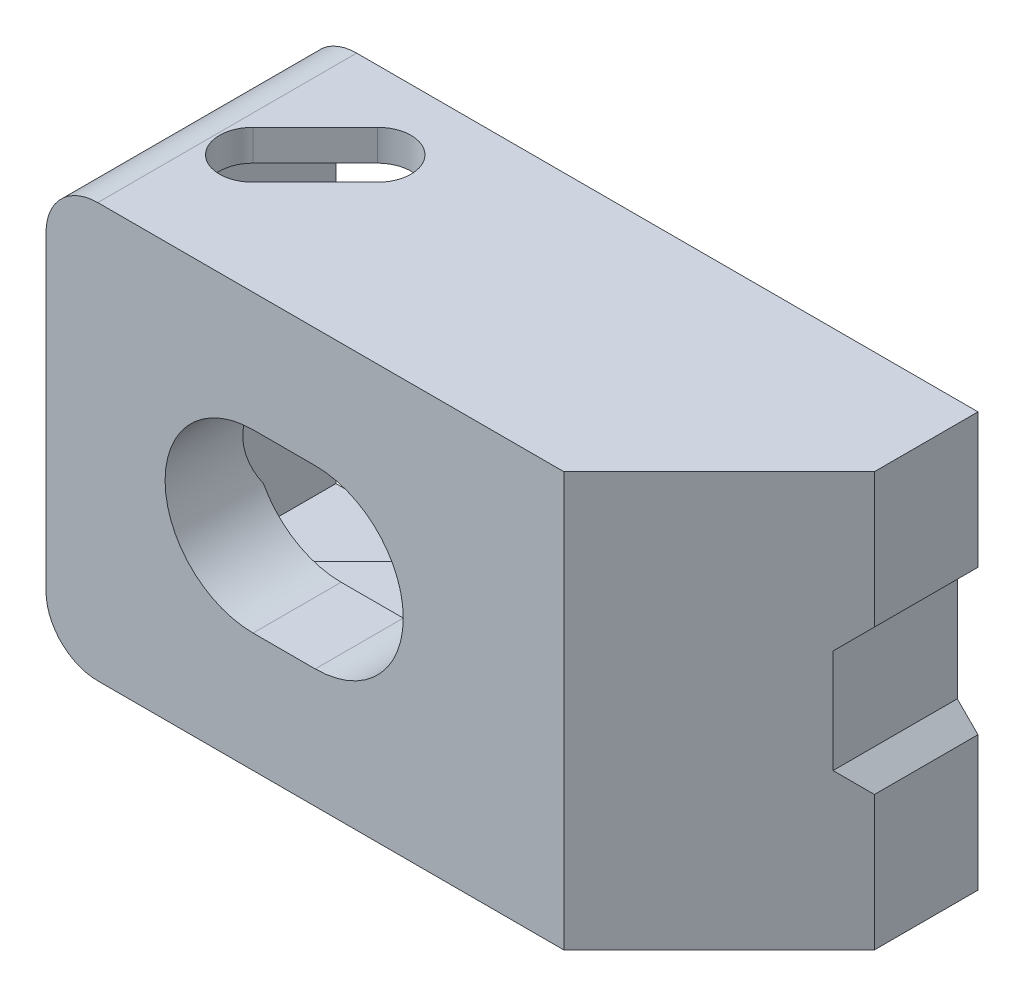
ISO-10303-21;
HEADER;
FILE_DESCRIPTION(('STEP AP214'),'2;1');
FILE_NAME('part.step','',(''),(''),'','','');
FILE_SCHEMA(('AUTOMOTIVE_DESIGN { 1 0 10303 214 1 1 1 1 }'));
ENDSEC;
DATA;
#1=APPLICATION_CONTEXT('core data for automotive mechanical design processes');
#2=APPLICATION_PROTOCOL_DEFINITION('international standard','automotive_design',2000,#1);
#3=PRODUCT_CONTEXT('',#1,'mechanical');
#4=PRODUCT('Part','Part','',(#3));
#5=PRODUCT_RELATED_PRODUCT_CATEGORY('part','',(#4));
#6=PRODUCT_DEFINITION_FORMATION('','',#4);
#7=PRODUCT_DEFINITION_CONTEXT('part definition',#1,'design');
#8=PRODUCT_DEFINITION('design','',#6,#7);
#9=PRODUCT_DEFINITION_SHAPE('','',#8);
#10=(LENGTH_UNIT() NAMED_UNIT(*) SI_UNIT(.MILLI.,.METRE.));
#11=(NAMED_UNIT(*) PLANE_ANGLE_UNIT() SI_UNIT($,.RADIAN.));
#12=(NAMED_UNIT(*) SI_UNIT($,.STERADIAN.) SOLID_ANGLE_UNIT());
#13=UNCERTAINTY_MEASURE_WITH_UNIT(LENGTH_MEASURE(1.E-05),#10,'distance_accuracy_value','');
#14=(GEOMETRIC_REPRESENTATION_CONTEXT(3) GLOBAL_UNCERTAINTY_ASSIGNED_CONTEXT((#13)) GLOBAL_UNIT_ASSIGNED_CONTEXT((#10,
#11,#12)) REPRESENTATION_CONTEXT('',''));
#15=CARTESIAN_POINT('',(0.,0.,0.));
#16=DIRECTION('',(0.,0.,1.));
#17=DIRECTION('',(1.,0.,0.));
#18=AXIS2_PLACEMENT_3D('',#15,#16,#17);
#19=CARTESIAN_POINT('',(39.,-20.,-40.3112887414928));
#20=DIRECTION('',(1.,0.,0.));
#21=DIRECTION('',(0.,0.,1.));
#22=AXIS2_PLACEMENT_3D('',#19,#20,#21);
#23=PLANE('',#22);
#24=DIRECTION('',(0.,1.,0.));
#25=VECTOR('',#24,1.);
#26=CARTESIAN_POINT('',(39.,-20.,10.));
#27=LINE('',#26,#25);
#28=CARTESIAN_POINT('',(39.,-20.,10.));
#29=VERTEX_POINT('',#28);
#30=CARTESIAN_POINT('',(39.,-7.,10.));
#31=VERTEX_POINT('',#30);
#32=EDGE_CURVE('E276',#29,#31,#27,.T.);
#33=ORIENTED_EDGE('',*,*,#32,.F.);
#34=DIRECTION('',(0.,0.,1.));
#35=VECTOR('',#34,1.);
#36=CARTESIAN_POINT('',(39.,-20.,-40.3112887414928));
#37=LINE('',#36,#35);
#38=CARTESIAN_POINT('',(39.,-20.,0.));
#39=VERTEX_POINT('',#38);
#40=EDGE_CURVE('E293',#39,#29,#37,.T.);
#41=ORIENTED_EDGE('',*,*,#40,.F.);
#42=DIRECTION('',(0.,-1.,0.));
#43=VECTOR('',#42,1.);
#44=CARTESIAN_POINT('',(39.,-20.,0.));
#45=LINE('',#44,#43);
#46=CARTESIAN_POINT('',(39.,-7.,0.));
#47=VERTEX_POINT('',#46);
#48=EDGE_CURVE('E292',#47,#39,#45,.T.);
#49=ORIENTED_EDGE('',*,*,#48,.F.);
#50=DIRECTION('',(0.,0.,-1.));
#51=VECTOR('',#50,1.);
#52=CARTESIAN_POINT('',(39.,-7.,-40.3112887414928));
#53=LINE('',#52,#51);
#54=EDGE_CURVE('E589',#31,#47,#53,.T.);
#55=ORIENTED_EDGE('',*,*,#54,.F.);
#56=EDGE_LOOP('',(#33,#41,#49,#55));
#57=FACE_BOUND('',#56,.T.);
#58=ADVANCED_FACE('F14',(#57),#23,.T.);
#59=CARTESIAN_POINT('',(0.,0.,16.5));
#60=DIRECTION('',(0.,0.,-1.));
#61=DIRECTION('',(1.,0.,0.));
#62=AXIS2_PLACEMENT_3D('',#59,#60,#61);
#63=CYLINDRICAL_SURFACE('',#62,10.5);
#64=CARTESIAN_POINT('',(0.,0.,9.));
#65=DIRECTION('',(0.,0.,1.));
#66=DIRECTION('',(-1.,0.,0.));
#67=AXIS2_PLACEMENT_3D('',#64,#65,#66);
#68=CIRCLE('',#67,10.5);
#69=CARTESIAN_POINT('',(0.,10.5,9.));
#70=VERTEX_POINT('',#69);
#71=CARTESIAN_POINT('',(8.94427190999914,5.5,9.));
#72=VERTEX_POINT('',#71);
#73=EDGE_CURVE('E532',#70,#72,#68,.F.);
#74=ORIENTED_EDGE('',*,*,#73,.T.);
#75=DIRECTION('',(0.,0.,-1.));
#76=VECTOR('',#75,1.);
#77=CARTESIAN_POINT('',(8.94427190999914,5.5,16.5));
#78=LINE('',#77,#76);
#79=CARTESIAN_POINT('',(8.94427190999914,5.5,16.5));
#80=VERTEX_POINT('',#79);
#81=EDGE_CURVE('E377',#80,#72,#78,.T.);
#82=ORIENTED_EDGE('',*,*,#81,.F.);
#83=CARTESIAN_POINT('',(0.,0.,16.5));
#84=DIRECTION('',(0.,0.,-1.));
#85=DIRECTION('',(1.,0.,0.));
#86=AXIS2_PLACEMENT_3D('',#83,#84,#85);
#87=CIRCLE('',#86,10.5);
#88=CARTESIAN_POINT('',(0.,10.5,16.5));
#89=VERTEX_POINT('',#88);
#90=EDGE_CURVE('E489',#89,#80,#87,.T.);
#91=ORIENTED_EDGE('',*,*,#90,.F.);
#92=DIRECTION('',(0.,0.,-1.));
#93=VECTOR('',#92,1.);
#94=CARTESIAN_POINT('',(0.,10.5,16.5));
#95=LINE('',#94,#93);
#96=EDGE_CURVE('E495',#89,#70,#95,.T.);
#97=ORIENTED_EDGE('',*,*,#96,.T.);
#98=EDGE_LOOP('',(#74,#82,#91,#97));
#99=FACE_BOUND('',#98,.T.);
#100=ADVANCED_FACE('F666',(#99),#63,.F.);
#101=CARTESIAN_POINT('',(19.4558441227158,-17.,9.));
#102=DIRECTION('',(0.,0.,1.));
#103=DIRECTION('',(-1.,0.,0.));
#104=AXIS2_PLACEMENT_3D('',#101,#102,#103);
#105=PLANE('',#104);
#106=DIRECTION('',(0.,1.,0.));
#107=VECTOR('',#106,1.);
#108=CARTESIAN_POINT('',(19.4558441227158,-17.,9.));
#109=LINE('',#108,#107);
#110=CARTESIAN_POINT('',(19.4558441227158,5.5,9.));
#111=VERTEX_POINT('',#110);
#112=CARTESIAN_POINT('',(19.4558441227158,17.,9.));
#113=VERTEX_POINT('',#112);
#114=EDGE_CURVE('E464',#111,#113,#109,.T.);
#115=ORIENTED_EDGE('',*,*,#114,.F.);
#116=DIRECTION('',(-1.,0.,0.));
#117=VECTOR('',#116,1.);
#118=CARTESIAN_POINT('',(19.4558441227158,5.5,9.));
#119=LINE('',#118,#117);
#120=EDGE_CURVE('E385',#111,#72,#119,.T.);
#121=ORIENTED_EDGE('',*,*,#120,.T.);
#122=ORIENTED_EDGE('',*,*,#73,.F.);
#123=DIRECTION('',(1.,0.,0.));
#124=VECTOR('',#123,1.);
#125=CARTESIAN_POINT('',(-23.,10.5,9.));
#126=LINE('',#125,#124);
#127=CARTESIAN_POINT('',(-6.,10.5,9.));
#128=VERTEX_POINT('',#127);
#129=EDGE_CURVE('E474',#128,#70,#126,.T.);
#130=ORIENTED_EDGE('',*,*,#129,.F.);
#131=DIRECTION('',(0.,1.,0.));
#132=VECTOR('',#131,1.);
#133=CARTESIAN_POINT('',(-6.,-17.,9.));
#134=LINE('',#133,#132);
#135=CARTESIAN_POINT('',(-6.,17.,9.));
#136=VERTEX_POINT('',#135);
#137=EDGE_CURVE('E468',#128,#136,#134,.T.);
#138=ORIENTED_EDGE('',*,*,#137,.T.);
#139=DIRECTION('',(1.,0.,0.));
#140=VECTOR('',#139,1.);
#141=CARTESIAN_POINT('',(19.4558441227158,17.,9.));
#142=LINE('',#141,#140);
#143=EDGE_CURVE('E425',#136,#113,#142,.T.);
#144=ORIENTED_EDGE('',*,*,#143,.T.);
#145=EDGE_LOOP('',(#115,#121,#122,#130,#138,#144));
#146=FACE_BOUND('',#145,.T.);
#147=ADVANCED_FACE('F624',(#146),#105,.F.);
#148=CARTESIAN_POINT('',(-6.,0.,0.));
#149=DIRECTION('',(0.,0.,1.));
#150=DIRECTION('',(-1.,0.,0.));
#151=AXIS2_PLACEMENT_3D('',#148,#149,#150);
#152=CYLINDRICAL_SURFACE('',#151,8.5);
#153=CARTESIAN_POINT('',(-6.,0.,16.5));
#154=DIRECTION('',(0.,0.,-1.));
#155=DIRECTION('',(1.,0.,0.));
#156=AXIS2_PLACEMENT_3D('',#153,#154,#155);
#157=CIRCLE('',#156,8.5);
#158=CARTESIAN_POINT('',(-13.5,-3.99999999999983,16.5));
#159=VERTEX_POINT('',#158);
#160=CARTESIAN_POINT('',(-6.,-8.5,16.5));
#161=VERTEX_POINT('',#160);
#162=EDGE_CURVE('E505',#159,#161,#157,.F.);
#163=ORIENTED_EDGE('',*,*,#162,.F.);
#164=CARTESIAN_POINT('',(-6.,0.,9.));
#165=DIRECTION('',(0.707106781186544,0.,0.707106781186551));
#166=DIRECTION('',(-0.707106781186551,0.,0.707106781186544));
#167=AXIS2_PLACEMENT_3D('',#164,#165,#166);
#168=ELLIPSE('',#167,12.0208152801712,8.5);
#169=CARTESIAN_POINT('',(-13.5,3.99999999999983,16.5));
#170=VERTEX_POINT('',#169);
#171=EDGE_CURVE('E479',#159,#170,#168,.F.);
#172=ORIENTED_EDGE('',*,*,#171,.T.);
#173=CARTESIAN_POINT('',(-6.,8.5,16.5));
#174=VERTEX_POINT('',#173);
#175=EDGE_CURVE('E506',#174,#170,#157,.F.);
#176=ORIENTED_EDGE('',*,*,#175,.F.);
#177=DIRECTION('',(0.,0.,1.));
#178=VECTOR('',#177,1.);
#179=CARTESIAN_POINT('',(-6.,8.5,0.));
#180=LINE('',#179,#178);
#181=CARTESIAN_POINT('',(-6.,8.5,25.));
#182=VERTEX_POINT('',#181);
#183=EDGE_CURVE('E520',#174,#182,#180,.T.);
#184=ORIENTED_EDGE('',*,*,#183,.T.);
#185=CARTESIAN_POINT('',(-6.,0.,25.));
#186=DIRECTION('',(0.,0.,1.));
#187=DIRECTION('',(1.,0.,0.));
#188=AXIS2_PLACEMENT_3D('',#185,#186,#187);
#189=CIRCLE('',#188,8.5);
#190=CARTESIAN_POINT('',(-6.,-8.5,25.));
#191=VERTEX_POINT('',#190);
#192=EDGE_CURVE('E509',#182,#191,#189,.T.);
#193=ORIENTED_EDGE('',*,*,#192,.T.);
#194=DIRECTION('',(0.,0.,1.));
#195=VECTOR('',#194,1.);
#196=CARTESIAN_POINT('',(-6.,-8.5,0.));
#197=LINE('',#196,#195);
#198=EDGE_CURVE('E519',#161,#191,#197,.T.);
#199=ORIENTED_EDGE('',*,*,#198,.F.);
#200=EDGE_LOOP('',(#163,#172,#176,#184,#193,#199));
#201=FACE_BOUND('',#200,.T.);
#202=ADVANCED_FACE('F634',(#201),#152,.F.);
#203=CARTESIAN_POINT('',(-6.,8.5,0.));
#204=DIRECTION('',(0.,1.,0.));
#205=DIRECTION('',(0.,0.,-1.));
#206=AXIS2_PLACEMENT_3D('',#203,#204,#205);
#207=PLANE('',#206);
#208=DIRECTION('',(-1.,0.,0.));
#209=VECTOR('',#208,1.);
#210=CARTESIAN_POINT('',(-6.,8.5,16.5));
#211=LINE('',#210,#209);
#212=CARTESIAN_POINT('',(0.,8.5,16.5));
#213=VERTEX_POINT('',#212);
#214=EDGE_CURVE('E503',#213,#174,#211,.T.);
#215=ORIENTED_EDGE('',*,*,#214,.F.);
#216=DIRECTION('',(0.,0.,1.));
#217=VECTOR('',#216,1.);
#218=CARTESIAN_POINT('',(0.,8.5,0.));
#219=LINE('',#218,#217);
#220=CARTESIAN_POINT('',(0.,8.5,25.));
#221=VERTEX_POINT('',#220);
#222=EDGE_CURVE('E524',#213,#221,#219,.T.);
#223=ORIENTED_EDGE('',*,*,#222,.T.);
#224=DIRECTION('',(-1.,0.,0.));
#225=VECTOR('',#224,1.);
#226=CARTESIAN_POINT('',(-6.,8.5,25.));
#227=LINE('',#226,#225);
#228=EDGE_CURVE('E517',#221,#182,#227,.T.);
#229=ORIENTED_EDGE('',*,*,#228,.T.);
#230=ORIENTED_EDGE('',*,*,#183,.F.);
#231=EDGE_LOOP('',(#215,#223,#229,#230));
#232=FACE_BOUND('',#231,.T.);
#233=ADVANCED_FACE('F653',(#232),#207,.F.);
#234=CARTESIAN_POINT('',(0.,0.,0.));
#235=DIRECTION('',(0.,0.,1.));
#236=DIRECTION('',(-1.,0.,0.));
#237=AXIS2_PLACEMENT_3D('',#234,#235,#236);
#238=CYLINDRICAL_SURFACE('',#237,8.5);
#239=CARTESIAN_POINT('',(0.,0.,16.5));
#240=DIRECTION('',(0.,0.,-1.));
#241=DIRECTION('',(1.,0.,0.));
#242=AXIS2_PLACEMENT_3D('',#239,#240,#241);
#243=CIRCLE('',#242,8.5);
#244=CARTESIAN_POINT('',(0.,-8.5,16.5));
#245=VERTEX_POINT('',#244);
#246=EDGE_CURVE('E499',#245,#213,#243,.F.);
#247=ORIENTED_EDGE('',*,*,#246,.F.);
#248=DIRECTION('',(0.,0.,1.));
#249=VECTOR('',#248,1.);
#250=CARTESIAN_POINT('',(0.,-8.5,0.));
#251=LINE('',#250,#249);
#252=CARTESIAN_POINT('',(0.,-8.5,25.));
#253=VERTEX_POINT('',#252);
#254=EDGE_CURVE('E526',#245,#253,#251,.T.);
#255=ORIENTED_EDGE('',*,*,#254,.T.);
#256=CARTESIAN_POINT('',(0.,0.,25.));
#257=DIRECTION('',(0.,0.,1.));
#258=DIRECTION('',(-1.,0.,0.));
#259=AXIS2_PLACEMENT_3D('',#256,#257,#258);
#260=CIRCLE('',#259,8.5);
#261=EDGE_CURVE('E514',#253,#221,#260,.T.);
#262=ORIENTED_EDGE('',*,*,#261,.T.);
#263=ORIENTED_EDGE('',*,*,#222,.F.);
#264=EDGE_LOOP('',(#247,#255,#262,#263));
#265=FACE_BOUND('',#264,.T.);
#266=ADVANCED_FACE('F645',(#265),#238,.F.);
#267=CARTESIAN_POINT('',(-6.,-8.5,0.));
#268=DIRECTION('',(0.,-1.,0.));
#269=DIRECTION('',(0.,0.,1.));
#270=AXIS2_PLACEMENT_3D('',#267,#268,#269);
#271=PLANE('',#270);
#272=DIRECTION('',(1.,0.,0.));
#273=VECTOR('',#272,1.);
#274=CARTESIAN_POINT('',(-6.,-8.5,16.5));
#275=LINE('',#274,#273);
#276=EDGE_CURVE('E523',#161,#245,#275,.T.);
#277=ORIENTED_EDGE('',*,*,#276,.F.);
#278=ORIENTED_EDGE('',*,*,#198,.T.);
#279=DIRECTION('',(1.,0.,0.));
#280=VECTOR('',#279,1.);
#281=CARTESIAN_POINT('',(-6.,-8.5,25.));
#282=LINE('',#281,#280);
#283=EDGE_CURVE('E512',#191,#253,#282,.T.);
#284=ORIENTED_EDGE('',*,*,#283,.T.);
#285=ORIENTED_EDGE('',*,*,#254,.F.);
#286=EDGE_LOOP('',(#277,#278,#284,#285));
#287=FACE_BOUND('',#286,.T.);
#288=ADVANCED_FACE('F641',(#287),#271,.F.);
#289=CARTESIAN_POINT('',(37.,17.,0.));
#290=DIRECTION('',(0.,0.,1.));
#291=DIRECTION('',(-1.,0.,0.));
#292=AXIS2_PLACEMENT_3D('',#289,#290,#291);
#293=PLANE('',#292);
#294=DIRECTION('',(-1.,0.,0.));
#295=VECTOR('',#294,1.);
#296=CARTESIAN_POINT('',(37.,17.,0.));
#297=LINE('',#296,#295);
#298=CARTESIAN_POINT('',(28.4558441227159,17.,0.));
#299=VERTEX_POINT('',#298);
#300=CARTESIAN_POINT('',(-23.,17.,0.));
#301=VERTEX_POINT('',#300);
#302=EDGE_CURVE('E416',#299,#301,#297,.T.);
#303=ORIENTED_EDGE('',*,*,#302,.T.);
#304=DIRECTION('',(0.,-1.,0.));
#305=VECTOR('',#304,1.);
#306=CARTESIAN_POINT('',(-23.,-20.,0.));
#307=LINE('',#306,#305);
#308=CARTESIAN_POINT('',(-23.,-17.,0.));
#309=VERTEX_POINT('',#308);
#310=EDGE_CURVE('E394',#301,#309,#307,.T.);
#311=ORIENTED_EDGE('',*,*,#310,.T.);
#312=DIRECTION('',(-1.,0.,0.));
#313=VECTOR('',#312,1.);
#314=CARTESIAN_POINT('',(37.,-17.,0.));
#315=LINE('',#314,#313);
#316=CARTESIAN_POINT('',(28.4558441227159,-17.,0.));
#317=VERTEX_POINT('',#316);
#318=EDGE_CURVE('E410',#317,#309,#315,.T.);
#319=ORIENTED_EDGE('',*,*,#318,.F.);
#320=DIRECTION('',(0.,1.,0.));
#321=VECTOR('',#320,1.);
#322=CARTESIAN_POINT('',(28.4558441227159,-17.,0.));
#323=LINE('',#322,#321);
#324=EDGE_CURVE('E441',#317,#299,#323,.T.);
#325=ORIENTED_EDGE('',*,*,#324,.T.);
#326=EDGE_LOOP('',(#303,#311,#319,#325));
#327=FACE_BOUND('',#326,.T.);
#328=DIRECTION('',(-1.,0.,0.));
#329=VECTOR('',#328,1.);
#330=CARTESIAN_POINT('',(37.,-20.,0.));
#331=LINE('',#330,#329);
#332=CARTESIAN_POINT('',(-21.,-20.,0.));
#333=VERTEX_POINT('',#332);
#334=EDGE_CURVE('E421',#39,#333,#331,.T.);
#335=ORIENTED_EDGE('',*,*,#334,.T.);
#336=CARTESIAN_POINT('',(-21.,-15.,0.));
#337=DIRECTION('',(0.,0.,1.));
#338=DIRECTION('',(-1.,0.,0.));
#339=AXIS2_PLACEMENT_3D('',#336,#337,#338);
#340=CIRCLE('',#339,5.);
#341=CARTESIAN_POINT('',(-26.,-15.,0.));
#342=VERTEX_POINT('',#341);
#343=EDGE_CURVE('E22',#333,#342,#340,.F.);
#344=ORIENTED_EDGE('',*,*,#343,.T.);
#345=DIRECTION('',(0.,-1.,0.));
#346=VECTOR('',#345,1.);
#347=CARTESIAN_POINT('',(-26.,-20.,0.));
#348=LINE('',#347,#346);
#349=CARTESIAN_POINT('',(-26.,15.,0.));
#350=VERTEX_POINT('',#349);
#351=EDGE_CURVE('E397',#350,#342,#348,.T.);
#352=ORIENTED_EDGE('',*,*,#351,.F.);
#353=CARTESIAN_POINT('',(-21.,15.,0.));
#354=DIRECTION('',(0.,0.,1.));
#355=DIRECTION('',(-1.,0.,0.));
#356=AXIS2_PLACEMENT_3D('',#353,#354,#355);
#357=CIRCLE('',#356,5.);
#358=CARTESIAN_POINT('',(-21.,20.,0.));
#359=VERTEX_POINT('',#358);
#360=EDGE_CURVE('E29',#350,#359,#357,.F.);
#361=ORIENTED_EDGE('',*,*,#360,.T.);
#362=DIRECTION('',(-1.,0.,0.));
#363=VECTOR('',#362,1.);
#364=CARTESIAN_POINT('',(37.,20.,0.));
#365=LINE('',#364,#363);
#366=CARTESIAN_POINT('',(39.,20.,0.));
#367=VERTEX_POINT('',#366);
#368=EDGE_CURVE('E540',#367,#359,#365,.T.);
#369=ORIENTED_EDGE('',*,*,#368,.F.);
#370=CARTESIAN_POINT('',(39.,7.,0.));
#371=VERTEX_POINT('',#370);
#372=EDGE_CURVE('E291',#367,#371,#45,.T.);
#373=ORIENTED_EDGE('',*,*,#372,.T.);
#374=DIRECTION('',(-0.707106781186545,-0.707106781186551,0.));
#375=VECTOR('',#374,1.);
#376=CARTESIAN_POINT('',(43.,11.,0.));
#377=LINE('',#376,#375);
#378=CARTESIAN_POINT('',(37.,5.,0.));
#379=VERTEX_POINT('',#378);
#380=EDGE_CURVE('E1026',#371,#379,#377,.T.);
#381=ORIENTED_EDGE('',*,*,#380,.T.);
#382=DIRECTION('',(0.,-1.,0.));
#383=VECTOR('',#382,1.);
#384=CARTESIAN_POINT('',(37.,17.,0.));
#385=LINE('',#384,#383);
#386=CARTESIAN_POINT('',(37.,-5.,0.));
#387=VERTEX_POINT('',#386);
#388=EDGE_CURVE('E297',#379,#387,#385,.T.);
#389=ORIENTED_EDGE('',*,*,#388,.T.);
#390=DIRECTION('',(0.707106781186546,-0.707106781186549,0.));
#391=VECTOR('',#390,1.);
#392=CARTESIAN_POINT('',(26.,6.,0.));
#393=LINE('',#392,#391);
#394=EDGE_CURVE('E1028',#387,#47,#393,.T.);
#395=ORIENTED_EDGE('',*,*,#394,.T.);
#396=ORIENTED_EDGE('',*,*,#48,.T.);
#397=EDGE_LOOP('',(#335,#344,#352,#361,#369,#373,#381,#389,#395,#396));
#398=FACE_BOUND('',#397,.T.);
#399=ADVANCED_FACE('F16',(#327,#398),#293,.F.);
#400=CARTESIAN_POINT('',(0.,0.,25.));
#401=DIRECTION('',(0.,0.,1.));
#402=DIRECTION('',(-1.,0.,0.));
#403=AXIS2_PLACEMENT_3D('',#400,#401,#402);
#404=PLANE('',#403);
#405=DIRECTION('',(0.,1.,0.));
#406=VECTOR('',#405,1.);
#407=CARTESIAN_POINT('',(-26.,-20.,25.));
#408=LINE('',#407,#406);
#409=CARTESIAN_POINT('',(-26.,-15.,25.));
#410=VERTEX_POINT('',#409);
#411=CARTESIAN_POINT('',(-26.,15.,25.));
#412=VERTEX_POINT('',#411);
#413=EDGE_CURVE('E391',#410,#412,#408,.T.);
#414=ORIENTED_EDGE('',*,*,#413,.F.);
#415=CARTESIAN_POINT('',(-21.,-15.,25.));
#416=DIRECTION('',(0.,0.,1.));
#417=DIRECTION('',(-1.,0.,0.));
#418=AXIS2_PLACEMENT_3D('',#415,#416,#417);
#419=CIRCLE('',#418,5.);
#420=CARTESIAN_POINT('',(-21.,-20.,25.));
#421=VERTEX_POINT('',#420);
#422=EDGE_CURVE('E580',#410,#421,#419,.T.);
#423=ORIENTED_EDGE('',*,*,#422,.T.);
#424=DIRECTION('',(-1.,0.,0.));
#425=VECTOR('',#424,1.);
#426=CARTESIAN_POINT('',(-1.,-20.,25.));
#427=LINE('',#426,#425);
#428=CARTESIAN_POINT('',(24.,-20.,25.));
#429=VERTEX_POINT('',#428);
#430=EDGE_CURVE('E389',#429,#421,#427,.T.);
#431=ORIENTED_EDGE('',*,*,#430,.F.);
#432=DIRECTION('',(0.,1.,0.));
#433=VECTOR('',#432,1.);
#434=CARTESIAN_POINT('',(24.,-20.,25.));
#435=LINE('',#434,#433);
#436=CARTESIAN_POINT('',(24.,20.,25.));
#437=VERTEX_POINT('',#436);
#438=EDGE_CURVE('E1020',#429,#437,#435,.T.);
#439=ORIENTED_EDGE('',*,*,#438,.T.);
#440=DIRECTION('',(-1.,0.,0.));
#441=VECTOR('',#440,1.);
#442=CARTESIAN_POINT('',(-1.,20.,25.));
#443=LINE('',#442,#441);
#444=CARTESIAN_POINT('',(-21.,20.,25.));
#445=VERTEX_POINT('',#444);
#446=EDGE_CURVE('E286',#437,#445,#443,.T.);
#447=ORIENTED_EDGE('',*,*,#446,.T.);
#448=CARTESIAN_POINT('',(-21.,15.,25.));
#449=DIRECTION('',(0.,0.,1.));
#450=DIRECTION('',(-1.,0.,0.));
#451=AXIS2_PLACEMENT_3D('',#448,#449,#450);
#452=CIRCLE('',#451,5.);
#453=EDGE_CURVE('E582',#445,#412,#452,.T.);
#454=ORIENTED_EDGE('',*,*,#453,.T.);
#455=EDGE_LOOP('',(#414,#423,#431,#439,#447,#454));
#456=FACE_BOUND('',#455,.T.);
#457=ORIENTED_EDGE('',*,*,#192,.F.);
#458=ORIENTED_EDGE('',*,*,#228,.F.);
#459=ORIENTED_EDGE('',*,*,#261,.F.);
#460=ORIENTED_EDGE('',*,*,#283,.F.);
#461=EDGE_LOOP('',(#457,#458,#459,#460));
#462=FACE_BOUND('',#461,.T.);
#463=ADVANCED_FACE('F650',(#456,#462),#404,.T.);
#464=CARTESIAN_POINT('',(0.,0.,16.5));
#465=DIRECTION('',(0.,0.,-1.));
#466=DIRECTION('',(1.,0.,0.));
#467=AXIS2_PLACEMENT_3D('',#464,#465,#466);
#468=PLANE('',#467);
#469=DIRECTION('',(0.,-1.,0.));
#470=VECTOR('',#469,1.);
#471=CARTESIAN_POINT('',(-13.5,0.,16.5));
#472=LINE('',#471,#470);
#473=CARTESIAN_POINT('',(-13.5,10.5,16.5));
#474=VERTEX_POINT('',#473);
#475=EDGE_CURVE('E480',#474,#170,#472,.T.);
#476=ORIENTED_EDGE('',*,*,#475,.F.);
#477=DIRECTION('',(1.,0.,0.));
#478=VECTOR('',#477,1.);
#479=CARTESIAN_POINT('',(-23.,10.5,16.5));
#480=LINE('',#479,#478);
#481=EDGE_CURVE('E486',#474,#89,#480,.T.);
#482=ORIENTED_EDGE('',*,*,#481,.T.);
#483=ORIENTED_EDGE('',*,*,#90,.T.);
#484=DIRECTION('',(1.,0.,0.));
#485=VECTOR('',#484,1.);
#486=CARTESIAN_POINT('',(20.,5.5,16.5));
#487=LINE('',#486,#485);
#488=CARTESIAN_POINT('',(20.,5.5,16.5));
#489=VERTEX_POINT('',#488);
#490=EDGE_CURVE('E369',#80,#489,#487,.T.);
#491=ORIENTED_EDGE('',*,*,#490,.T.);
#492=CARTESIAN_POINT('',(20.,0.,16.5));
#493=DIRECTION('',(0.,0.,-1.));
#494=DIRECTION('',(1.,0.,0.));
#495=AXIS2_PLACEMENT_3D('',#492,#493,#494);
#496=CIRCLE('',#495,5.5);
#497=CARTESIAN_POINT('',(20.,-5.5,16.5));
#498=VERTEX_POINT('',#497);
#499=EDGE_CURVE('E363',#489,#498,#496,.T.);
#500=ORIENTED_EDGE('',*,*,#499,.T.);
#501=DIRECTION('',(-1.,0.,0.));
#502=VECTOR('',#501,1.);
#503=CARTESIAN_POINT('',(20.,-5.5,16.5));
#504=LINE('',#503,#502);
#505=CARTESIAN_POINT('',(8.94427190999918,-5.5,16.5));
#506=VERTEX_POINT('',#505);
#507=EDGE_CURVE('E366',#498,#506,#504,.T.);
#508=ORIENTED_EDGE('',*,*,#507,.T.);
#509=CARTESIAN_POINT('',(0.,-10.5,16.5));
#510=VERTEX_POINT('',#509);
#511=EDGE_CURVE('E488',#506,#510,#87,.T.);
#512=ORIENTED_EDGE('',*,*,#511,.T.);
#513=DIRECTION('',(-1.,0.,0.));
#514=VECTOR('',#513,1.);
#515=CARTESIAN_POINT('',(-23.,-10.5,16.5));
#516=LINE('',#515,#514);
#517=CARTESIAN_POINT('',(-13.5,-10.5,16.5));
#518=VERTEX_POINT('',#517);
#519=EDGE_CURVE('E492',#510,#518,#516,.T.);
#520=ORIENTED_EDGE('',*,*,#519,.T.);
#521=EDGE_CURVE('E477',#159,#518,#472,.T.);
#522=ORIENTED_EDGE('',*,*,#521,.F.);
#523=ORIENTED_EDGE('',*,*,#162,.T.);
#524=ORIENTED_EDGE('',*,*,#276,.T.);
#525=ORIENTED_EDGE('',*,*,#246,.T.);
#526=ORIENTED_EDGE('',*,*,#214,.T.);
#527=ORIENTED_EDGE('',*,*,#175,.T.);
#528=EDGE_LOOP('',(#476,#482,#483,#491,#500,#508,#512,#520,#522,#523,#524,#525,#526,#527));
#529=FACE_BOUND('',#528,.T.);
#530=ADVANCED_FACE('F615',(#529),#468,.T.);
#531=CARTESIAN_POINT('',(-23.,10.5,16.5));
#532=DIRECTION('',(0.,1.,0.));
#533=DIRECTION('',(0.,0.,-1.));
#534=AXIS2_PLACEMENT_3D('',#531,#532,#533);
#535=PLANE('',#534);
#536=DIRECTION('',(0.707106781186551,0.,-0.707106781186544));
#537=VECTOR('',#536,1.);
#538=CARTESIAN_POINT('',(-18.25,10.5,21.25));
#539=LINE('',#538,#537);
#540=EDGE_CURVE('E483',#474,#128,#539,.T.);
#541=ORIENTED_EDGE('',*,*,#540,.T.);
#542=ORIENTED_EDGE('',*,*,#129,.T.);
#543=ORIENTED_EDGE('',*,*,#96,.F.);
#544=ORIENTED_EDGE('',*,*,#481,.F.);
#545=EDGE_LOOP('',(#541,#542,#543,#544));
#546=FACE_BOUND('',#545,.T.);
#547=ADVANCED_FACE('F627',(#546),#535,.F.);
#548=CARTESIAN_POINT('',(-23.,-10.5,16.5));
#549=DIRECTION('',(0.,-1.,0.));
#550=DIRECTION('',(1.,0.,0.));
#551=AXIS2_PLACEMENT_3D('',#548,#549,#550);
#552=PLANE('',#551);
#553=DIRECTION('',(0.,0.,-1.));
#554=VECTOR('',#553,1.);
#555=CARTESIAN_POINT('',(0.,-10.5,16.5));
#556=LINE('',#555,#554);
#557=CARTESIAN_POINT('',(0.,-10.5,9.));
#558=VERTEX_POINT('',#557);
#559=EDGE_CURVE('E496',#510,#558,#556,.T.);
#560=ORIENTED_EDGE('',*,*,#559,.T.);
#561=DIRECTION('',(-1.,0.,0.));
#562=VECTOR('',#561,1.);
#563=CARTESIAN_POINT('',(-23.,-10.5,9.));
#564=LINE('',#563,#562);
#565=CARTESIAN_POINT('',(-6.,-10.5,9.));
#566=VERTEX_POINT('',#565);
#567=EDGE_CURVE('E444',#558,#566,#564,.T.);
#568=ORIENTED_EDGE('',*,*,#567,.T.);
#569=DIRECTION('',(-0.707106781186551,0.,0.707106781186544));
#570=VECTOR('',#569,1.);
#571=CARTESIAN_POINT('',(-18.25,-10.5,21.25));
#572=LINE('',#571,#570);
#573=EDGE_CURVE('E535',#566,#518,#572,.T.);
#574=ORIENTED_EDGE('',*,*,#573,.T.);
#575=ORIENTED_EDGE('',*,*,#519,.F.);
#576=EDGE_LOOP('',(#560,#568,#574,#575));
#577=FACE_BOUND('',#576,.T.);
#578=ADVANCED_FACE('F767',(#577),#552,.F.);
#579=ORIENTED_EDGE('',*,*,#511,.F.);
#580=DIRECTION('',(0.,0.,-1.));
#581=VECTOR('',#580,1.);
#582=CARTESIAN_POINT('',(8.94427190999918,-5.5,16.5));
#583=LINE('',#582,#581);
#584=CARTESIAN_POINT('',(8.94427190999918,-5.5,9.));
#585=VERTEX_POINT('',#584);
#586=EDGE_CURVE('E379',#506,#585,#583,.T.);
#587=ORIENTED_EDGE('',*,*,#586,.T.);
#588=EDGE_CURVE('E531',#585,#558,#68,.F.);
#589=ORIENTED_EDGE('',*,*,#588,.T.);
#590=ORIENTED_EDGE('',*,*,#559,.F.);
#591=EDGE_LOOP('',(#579,#587,#589,#590));
#592=FACE_BOUND('',#591,.T.);
#593=ADVANCED_FACE('F611',(#592),#63,.F.);
#594=CARTESIAN_POINT('',(-6.,-17.,9.));
#595=DIRECTION('',(0.707106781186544,0.,0.707106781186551));
#596=DIRECTION('',(-0.707106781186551,0.,0.707106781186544));
#597=AXIS2_PLACEMENT_3D('',#594,#595,#596);
#598=PLANE('',#597);
#599=ORIENTED_EDGE('',*,*,#475,.T.);
#600=ORIENTED_EDGE('',*,*,#171,.F.);
#601=ORIENTED_EDGE('',*,*,#521,.T.);
#602=ORIENTED_EDGE('',*,*,#573,.F.);
#603=CARTESIAN_POINT('',(-6.,-17.,9.));
#604=VERTEX_POINT('',#603);
#605=EDGE_CURVE('E465',#604,#566,#134,.T.);
#606=ORIENTED_EDGE('',*,*,#605,.F.);
#607=DIRECTION('',(0.707106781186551,0.,-0.707106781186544));
#608=VECTOR('',#607,1.);
#609=CARTESIAN_POINT('',(-6.,-17.,9.));
#610=LINE('',#609,#608);
#611=CARTESIAN_POINT('',(-17.,-17.,20.));
#612=VERTEX_POINT('',#611);
#613=EDGE_CURVE('E432',#612,#604,#610,.T.);
#614=ORIENTED_EDGE('',*,*,#613,.F.);
#615=DIRECTION('',(0.,1.,0.));
#616=VECTOR('',#615,1.);
#617=CARTESIAN_POINT('',(-17.,-17.,20.));
#618=LINE('',#617,#616);
#619=CARTESIAN_POINT('',(-17.,17.,20.));
#620=VERTEX_POINT('',#619);
#621=EDGE_CURVE('E469',#612,#620,#618,.T.);
#622=ORIENTED_EDGE('',*,*,#621,.T.);
#623=DIRECTION('',(0.707106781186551,0.,-0.707106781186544));
#624=VECTOR('',#623,1.);
#625=CARTESIAN_POINT('',(-6.,17.,9.));
#626=LINE('',#625,#624);
#627=EDGE_CURVE('E422',#620,#136,#626,.T.);
#628=ORIENTED_EDGE('',*,*,#627,.T.);
#629=ORIENTED_EDGE('',*,*,#137,.F.);
#630=ORIENTED_EDGE('',*,*,#540,.F.);
#631=EDGE_LOOP('',(#599,#600,#601,#602,#606,#614,#622,#628,#629,#630));
#632=FACE_BOUND('',#631,.T.);
#633=ADVANCED_FACE('F557',(#632),#598,.F.);
#634=ORIENTED_EDGE('',*,*,#588,.F.);
#635=DIRECTION('',(1.,0.,0.));
#636=VECTOR('',#635,1.);
#637=CARTESIAN_POINT('',(19.4558441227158,-5.5,9.));
#638=LINE('',#637,#636);
#639=CARTESIAN_POINT('',(19.4558441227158,-5.5,9.));
#640=VERTEX_POINT('',#639);
#641=EDGE_CURVE('E376',#585,#640,#638,.T.);
#642=ORIENTED_EDGE('',*,*,#641,.T.);
#643=CARTESIAN_POINT('',(19.4558441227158,-17.,9.));
#644=VERTEX_POINT('',#643);
#645=EDGE_CURVE('E445',#644,#640,#109,.T.);
#646=ORIENTED_EDGE('',*,*,#645,.F.);
#647=DIRECTION('',(1.,0.,0.));
#648=VECTOR('',#647,1.);
#649=CARTESIAN_POINT('',(19.4558441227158,-17.,9.));
#650=LINE('',#649,#648);
#651=EDGE_CURVE('E457',#604,#644,#650,.T.);
#652=ORIENTED_EDGE('',*,*,#651,.F.);
#653=ORIENTED_EDGE('',*,*,#605,.T.);
#654=ORIENTED_EDGE('',*,*,#567,.F.);
#655=EDGE_LOOP('',(#634,#642,#646,#652,#653,#654));
#656=FACE_BOUND('',#655,.T.);
#657=ADVANCED_FACE('F606',(#656),#105,.F.);
#658=CARTESIAN_POINT('',(28.4558441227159,-17.,0.));
#659=DIRECTION('',(0.707106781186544,0.,0.707106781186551));
#660=DIRECTION('',(-0.707106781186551,0.,0.707106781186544));
#661=AXIS2_PLACEMENT_3D('',#658,#659,#660);
#662=PLANE('',#661);
#663=CARTESIAN_POINT('',(20.,0.,8.45584412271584));
#664=DIRECTION('',(0.707106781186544,0.,0.707106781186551));
#665=DIRECTION('',(0.707106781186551,0.,-0.707106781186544));
#666=AXIS2_PLACEMENT_3D('',#663,#664,#665);
#667=ELLIPSE('',#666,7.77817459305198,5.5);
#668=CARTESIAN_POINT('',(20.,-5.5,8.45584412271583));
#669=VERTEX_POINT('',#668);
#670=CARTESIAN_POINT('',(20.,5.5,8.45584412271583));
#671=VERTEX_POINT('',#670);
#672=EDGE_CURVE('E595',#669,#671,#667,.T.);
#673=ORIENTED_EDGE('',*,*,#672,.T.);
#674=DIRECTION('',(-0.707106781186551,0.,0.707106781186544));
#675=VECTOR('',#674,1.);
#676=CARTESIAN_POINT('',(28.4558441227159,5.5,0.));
#677=LINE('',#676,#675);
#678=EDGE_CURVE('E593',#671,#111,#677,.T.);
#679=ORIENTED_EDGE('',*,*,#678,.T.);
#680=ORIENTED_EDGE('',*,*,#114,.T.);
#681=DIRECTION('',(0.707106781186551,0.,-0.707106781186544));
#682=VECTOR('',#681,1.);
#683=CARTESIAN_POINT('',(28.4558441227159,17.,0.));
#684=LINE('',#683,#682);
#685=EDGE_CURVE('E429',#113,#299,#684,.T.);
#686=ORIENTED_EDGE('',*,*,#685,.T.);
#687=ORIENTED_EDGE('',*,*,#324,.F.);
#688=DIRECTION('',(0.707106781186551,0.,-0.707106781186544));
#689=VECTOR('',#688,1.);
#690=CARTESIAN_POINT('',(28.4558441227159,-17.,0.));
#691=LINE('',#690,#689);
#692=EDGE_CURVE('E452',#644,#317,#691,.T.);
#693=ORIENTED_EDGE('',*,*,#692,.F.);
#694=ORIENTED_EDGE('',*,*,#645,.T.);
#695=DIRECTION('',(0.707106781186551,0.,-0.707106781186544));
#696=VECTOR('',#695,1.);
#697=CARTESIAN_POINT('',(28.4558441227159,-5.5,0.));
#698=LINE('',#697,#696);
#699=EDGE_CURVE('E458',#640,#669,#698,.T.);
#700=ORIENTED_EDGE('',*,*,#699,.T.);
#701=EDGE_LOOP('',(#673,#679,#680,#686,#687,#693,#694,#700));
#702=FACE_BOUND('',#701,.T.);
#703=ADVANCED_FACE('F600',(#702),#662,.F.);
#704=CARTESIAN_POINT('',(-17.,-17.,20.));
#705=DIRECTION('',(0.,0.,1.));
#706=DIRECTION('',(-1.,0.,0.));
#707=AXIS2_PLACEMENT_3D('',#704,#705,#706);
#708=PLANE('',#707);
#709=DIRECTION('',(1.,0.,0.));
#710=VECTOR('',#709,1.);
#711=CARTESIAN_POINT('',(-17.,17.,20.));
#712=LINE('',#711,#710);
#713=CARTESIAN_POINT('',(-23.,17.,20.));
#714=VERTEX_POINT('',#713);
#715=EDGE_CURVE('E426',#714,#620,#712,.T.);
#716=ORIENTED_EDGE('',*,*,#715,.T.);
#717=ORIENTED_EDGE('',*,*,#621,.F.);
#718=DIRECTION('',(1.,0.,0.));
#719=VECTOR('',#718,1.);
#720=CARTESIAN_POINT('',(-17.,-17.,20.));
#721=LINE('',#720,#719);
#722=CARTESIAN_POINT('',(-23.,-17.,20.));
#723=VERTEX_POINT('',#722);
#724=EDGE_CURVE('E438',#723,#612,#721,.T.);
#725=ORIENTED_EDGE('',*,*,#724,.F.);
#726=DIRECTION('',(0.,1.,0.));
#727=VECTOR('',#726,1.);
#728=CARTESIAN_POINT('',(-23.,-17.,20.));
#729=LINE('',#728,#727);
#730=EDGE_CURVE('E456',#723,#714,#729,.T.);
#731=ORIENTED_EDGE('',*,*,#730,.T.);
#732=EDGE_LOOP('',(#716,#717,#725,#731));
#733=FACE_BOUND('',#732,.T.);
#734=ADVANCED_FACE('F545',(#733),#708,.F.);
#735=CARTESIAN_POINT('',(37.,20.,40.));
#736=DIRECTION('',(0.,1.,0.));
#737=DIRECTION('',(-1.,0.,0.));
#738=AXIS2_PLACEMENT_3D('',#735,#736,#737);
#739=PLANE('',#738);
#740=ORIENTED_EDGE('',*,*,#368,.T.);
#741=DIRECTION('',(0.,0.,-1.));
#742=VECTOR('',#741,1.);
#743=CARTESIAN_POINT('',(-21.,20.,40.));
#744=LINE('',#743,#742);
#745=EDGE_CURVE('E9',#359,#445,#744,.F.);
#746=ORIENTED_EDGE('',*,*,#745,.T.);
#747=ORIENTED_EDGE('',*,*,#446,.F.);
#748=DIRECTION('',(-0.707106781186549,0.,0.707106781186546));
#749=VECTOR('',#748,1.);
#750=CARTESIAN_POINT('',(39.,20.,10.));
#751=LINE('',#750,#749);
#752=CARTESIAN_POINT('',(39.,20.,10.));
#753=VERTEX_POINT('',#752);
#754=EDGE_CURVE('E268',#753,#437,#751,.T.);
#755=ORIENTED_EDGE('',*,*,#754,.F.);
#756=DIRECTION('',(0.,0.,1.));
#757=VECTOR('',#756,1.);
#758=CARTESIAN_POINT('',(39.,20.,-40.3112887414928));
#759=LINE('',#758,#757);
#760=EDGE_CURVE('E284',#367,#753,#759,.T.);
#761=ORIENTED_EDGE('',*,*,#760,.F.);
#762=EDGE_LOOP('',(#740,#746,#747,#755,#761));
#763=FACE_BOUND('',#762,.T.);
#764=CARTESIAN_POINT('',(-17.5,20.,13.5));
#765=DIRECTION('',(0.,1.,0.));
#766=DIRECTION('',(-1.,0.,0.));
#767=AXIS2_PLACEMENT_3D('',#764,#765,#766);
#768=CIRCLE('',#767,3.25);
#769=CARTESIAN_POINT('',(-19.7980970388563,20.,11.2019029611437));
#770=VERTEX_POINT('',#769);
#771=CARTESIAN_POINT('',(-15.2019029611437,20.,15.7980970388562));
#772=VERTEX_POINT('',#771);
#773=EDGE_CURVE('E301',#770,#772,#768,.T.);
#774=ORIENTED_EDGE('',*,*,#773,.F.);
#775=DIRECTION('',(-0.707106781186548,0.,0.707106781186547));
#776=VECTOR('',#775,1.);
#777=CARTESIAN_POINT('',(-19.7980970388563,20.,11.2019029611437));
#778=LINE('',#777,#776);
#779=CARTESIAN_POINT('',(-13.7980970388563,20.,5.20190296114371));
#780=VERTEX_POINT('',#779);
#781=EDGE_CURVE('E309',#780,#770,#778,.T.);
#782=ORIENTED_EDGE('',*,*,#781,.F.);
#783=CARTESIAN_POINT('',(-11.5,20.,7.5));
#784=DIRECTION('',(0.,1.,0.));
#785=DIRECTION('',(-1.,0.,0.));
#786=AXIS2_PLACEMENT_3D('',#783,#784,#785);
#787=CIRCLE('',#786,3.25);
#788=CARTESIAN_POINT('',(-9.20190296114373,20.,9.79809703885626));
#789=VERTEX_POINT('',#788);
#790=EDGE_CURVE('E306',#789,#780,#787,.T.);
#791=ORIENTED_EDGE('',*,*,#790,.F.);
#792=DIRECTION('',(0.707106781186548,0.,-0.707106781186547));
#793=VECTOR('',#792,1.);
#794=CARTESIAN_POINT('',(-15.2019029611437,20.,15.7980970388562));
#795=LINE('',#794,#793);
#796=EDGE_CURVE('E303',#772,#789,#795,.T.);
#797=ORIENTED_EDGE('',*,*,#796,.F.);
#798=EDGE_LOOP('',(#774,#782,#791,#797));
#799=FACE_BOUND('',#798,.T.);
#800=ADVANCED_FACE('F282',(#763,#799),#739,.T.);
#801=CARTESIAN_POINT('',(37.,17.,40.));
#802=DIRECTION('',(0.,1.,0.));
#803=DIRECTION('',(-1.,0.,0.));
#804=AXIS2_PLACEMENT_3D('',#801,#802,#803);
#805=PLANE('',#804);
#806=DIRECTION('',(-0.707106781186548,0.,0.707106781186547));
#807=VECTOR('',#806,1.);
#808=CARTESIAN_POINT('',(-5.79809703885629,17.,-2.79809703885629));
#809=LINE('',#808,#807);
#810=CARTESIAN_POINT('',(-13.7980970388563,17.,5.20190296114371));
#811=VERTEX_POINT('',#810);
#812=CARTESIAN_POINT('',(-19.7980970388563,17.,11.2019029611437));
#813=VERTEX_POINT('',#812);
#814=EDGE_CURVE('E354',#811,#813,#809,.T.);
#815=ORIENTED_EDGE('',*,*,#814,.T.);
#816=CARTESIAN_POINT('',(-17.5,17.,13.5));
#817=DIRECTION('',(0.,1.,0.));
#818=DIRECTION('',(-1.,0.,0.));
#819=AXIS2_PLACEMENT_3D('',#816,#817,#818);
#820=CIRCLE('',#819,3.25);
#821=CARTESIAN_POINT('',(-15.2019029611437,17.,15.7980970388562));
#822=VERTEX_POINT('',#821);
#823=EDGE_CURVE('E360',#813,#822,#820,.T.);
#824=ORIENTED_EDGE('',*,*,#823,.T.);
#825=DIRECTION('',(0.707106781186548,0.,-0.707106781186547));
#826=VECTOR('',#825,1.);
#827=CARTESIAN_POINT('',(-1.20190296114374,17.,1.79809703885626));
#828=LINE('',#827,#826);
#829=CARTESIAN_POINT('',(-9.20190296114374,17.,9.79809703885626));
#830=VERTEX_POINT('',#829);
#831=EDGE_CURVE('E342',#822,#830,#828,.T.);
#832=ORIENTED_EDGE('',*,*,#831,.T.);
#833=CARTESIAN_POINT('',(-11.5,17.,7.5));
#834=DIRECTION('',(0.,1.,0.));
#835=DIRECTION('',(-1.,0.,0.));
#836=AXIS2_PLACEMENT_3D('',#833,#834,#835);
#837=CIRCLE('',#836,3.25);
#838=EDGE_CURVE('E348',#830,#811,#837,.T.);
#839=ORIENTED_EDGE('',*,*,#838,.T.);
#840=EDGE_LOOP('',(#815,#824,#832,#839));
#841=FACE_BOUND('',#840,.T.);
#842=ORIENTED_EDGE('',*,*,#685,.F.);
#843=ORIENTED_EDGE('',*,*,#143,.F.);
#844=ORIENTED_EDGE('',*,*,#627,.F.);
#845=ORIENTED_EDGE('',*,*,#715,.F.);
#846=DIRECTION('',(0.,0.,1.));
#847=VECTOR('',#846,1.);
#848=CARTESIAN_POINT('',(-23.,17.,0.));
#849=LINE('',#848,#847);
#850=EDGE_CURVE('E420',#301,#714,#849,.T.);
#851=ORIENTED_EDGE('',*,*,#850,.F.);
#852=ORIENTED_EDGE('',*,*,#302,.F.);
#853=EDGE_LOOP('',(#842,#843,#844,#845,#851,#852));
#854=FACE_BOUND('',#853,.T.);
#855=ADVANCED_FACE('F552',(#841,#854),#805,.F.);
#856=CARTESIAN_POINT('',(37.,-17.,40.));
#857=DIRECTION('',(0.,-1.,0.));
#858=DIRECTION('',(-1.,0.,0.));
#859=AXIS2_PLACEMENT_3D('',#856,#857,#858);
#860=PLANE('',#859);
#861=DIRECTION('',(-0.707106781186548,0.,0.707106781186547));
#862=VECTOR('',#861,1.);
#863=CARTESIAN_POINT('',(-1.20190296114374,-17.,1.79809703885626));
#864=LINE('',#863,#862);
#865=CARTESIAN_POINT('',(-9.20190296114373,-17.,9.79809703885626));
#866=VERTEX_POINT('',#865);
#867=CARTESIAN_POINT('',(-15.2019029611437,-17.,15.7980970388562));
#868=VERTEX_POINT('',#867);
#869=EDGE_CURVE('E328',#866,#868,#864,.T.);
#870=ORIENTED_EDGE('',*,*,#869,.T.);
#871=CARTESIAN_POINT('',(-17.5,-17.,13.5));
#872=DIRECTION('',(0.,-1.,0.));
#873=DIRECTION('',(1.,0.,0.));
#874=AXIS2_PLACEMENT_3D('',#871,#872,#873);
#875=CIRCLE('',#874,3.25);
#876=CARTESIAN_POINT('',(-19.7980970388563,-17.,11.2019029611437));
#877=VERTEX_POINT('',#876);
#878=EDGE_CURVE('E357',#868,#877,#875,.T.);
#879=ORIENTED_EDGE('',*,*,#878,.T.);
#880=DIRECTION('',(0.707106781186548,0.,-0.707106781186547));
#881=VECTOR('',#880,1.);
#882=CARTESIAN_POINT('',(-5.79809703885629,-17.,-2.7980970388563));
#883=LINE('',#882,#881);
#884=CARTESIAN_POINT('',(-13.7980970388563,-17.,5.20190296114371));
#885=VERTEX_POINT('',#884);
#886=EDGE_CURVE('E351',#877,#885,#883,.T.);
#887=ORIENTED_EDGE('',*,*,#886,.T.);
#888=CARTESIAN_POINT('',(-11.5,-17.,7.5));
#889=DIRECTION('',(0.,-1.,0.));
#890=DIRECTION('',(1.,0.,0.));
#891=AXIS2_PLACEMENT_3D('',#888,#889,#890);
#892=CIRCLE('',#891,3.25);
#893=EDGE_CURVE('E345',#885,#866,#892,.T.);
#894=ORIENTED_EDGE('',*,*,#893,.T.);
#895=EDGE_LOOP('',(#870,#879,#887,#894));
#896=FACE_BOUND('',#895,.T.);
#897=ORIENTED_EDGE('',*,*,#651,.T.);
#898=ORIENTED_EDGE('',*,*,#692,.T.);
#899=ORIENTED_EDGE('',*,*,#318,.T.);
#900=DIRECTION('',(0.,0.,1.));
#901=VECTOR('',#900,1.);
#902=CARTESIAN_POINT('',(-23.,-17.,0.));
#903=LINE('',#902,#901);
#904=EDGE_CURVE('E406',#309,#723,#903,.T.);
#905=ORIENTED_EDGE('',*,*,#904,.T.);
#906=ORIENTED_EDGE('',*,*,#724,.T.);
#907=ORIENTED_EDGE('',*,*,#613,.T.);
#908=EDGE_LOOP('',(#897,#898,#899,#905,#906,#907));
#909=FACE_BOUND('',#908,.T.);
#910=ADVANCED_FACE('F562',(#896,#909),#860,.F.);
#911=CARTESIAN_POINT('',(37.,-20.,40.));
#912=DIRECTION('',(0.,-1.,0.));
#913=DIRECTION('',(-1.,0.,0.));
#914=AXIS2_PLACEMENT_3D('',#911,#912,#913);
#915=PLANE('',#914);
#916=ORIENTED_EDGE('',*,*,#430,.T.);
#917=DIRECTION('',(0.,0.,1.));
#918=VECTOR('',#917,1.);
#919=CARTESIAN_POINT('',(-21.,-20.,40.));
#920=LINE('',#919,#918);
#921=EDGE_CURVE('E37',#421,#333,#920,.F.);
#922=ORIENTED_EDGE('',*,*,#921,.T.);
#923=ORIENTED_EDGE('',*,*,#334,.F.);
#924=ORIENTED_EDGE('',*,*,#40,.T.);
#925=DIRECTION('',(-0.707106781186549,0.,0.707106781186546));
#926=VECTOR('',#925,1.);
#927=CARTESIAN_POINT('',(39.,-20.,10.));
#928=LINE('',#927,#926);
#929=EDGE_CURVE('E277',#29,#429,#928,.T.);
#930=ORIENTED_EDGE('',*,*,#929,.T.);
#931=EDGE_LOOP('',(#916,#922,#923,#924,#930));
#932=FACE_BOUND('',#931,.T.);
#933=CARTESIAN_POINT('',(-17.5,-20.,13.5));
#934=DIRECTION('',(0.,1.,0.));
#935=DIRECTION('',(-1.,0.,0.));
#936=AXIS2_PLACEMENT_3D('',#933,#934,#935);
#937=CIRCLE('',#936,3.25);
#938=CARTESIAN_POINT('',(-19.7980970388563,-20.,11.2019029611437));
#939=VERTEX_POINT('',#938);
#940=CARTESIAN_POINT('',(-15.2019029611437,-20.,15.7980970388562));
#941=VERTEX_POINT('',#940);
#942=EDGE_CURVE('E312',#939,#941,#937,.T.);
#943=ORIENTED_EDGE('',*,*,#942,.T.);
#944=DIRECTION('',(0.707106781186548,0.,-0.707106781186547));
#945=VECTOR('',#944,1.);
#946=CARTESIAN_POINT('',(-15.2019029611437,-20.,15.7980970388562));
#947=LINE('',#946,#945);
#948=CARTESIAN_POINT('',(-9.20190296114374,-20.,9.79809703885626));
#949=VERTEX_POINT('',#948);
#950=EDGE_CURVE('E315',#941,#949,#947,.T.);
#951=ORIENTED_EDGE('',*,*,#950,.T.);
#952=CARTESIAN_POINT('',(-11.5,-20.,7.5));
#953=DIRECTION('',(0.,1.,0.));
#954=DIRECTION('',(-1.,0.,0.));
#955=AXIS2_PLACEMENT_3D('',#952,#953,#954);
#956=CIRCLE('',#955,3.25);
#957=CARTESIAN_POINT('',(-13.7980970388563,-20.,5.20190296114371));
#958=VERTEX_POINT('',#957);
#959=EDGE_CURVE('E318',#949,#958,#956,.T.);
#960=ORIENTED_EDGE('',*,*,#959,.T.);
#961=DIRECTION('',(-0.707106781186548,0.,0.707106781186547));
#962=VECTOR('',#961,1.);
#963=CARTESIAN_POINT('',(-19.7980970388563,-20.,11.2019029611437));
#964=LINE('',#963,#962);
#965=EDGE_CURVE('E321',#958,#939,#964,.T.);
#966=ORIENTED_EDGE('',*,*,#965,.T.);
#967=EDGE_LOOP('',(#943,#951,#960,#966));
#968=FACE_BOUND('',#967,.T.);
#969=ADVANCED_FACE('F716',(#932,#968),#915,.T.);
#970=CARTESIAN_POINT('',(-23.,20.,40.));
#971=DIRECTION('',(-1.,0.,0.));
#972=DIRECTION('',(0.,0.,-1.));
#973=AXIS2_PLACEMENT_3D('',#970,#971,#972);
#974=PLANE('',#973);
#975=ORIENTED_EDGE('',*,*,#310,.F.);
#976=ORIENTED_EDGE('',*,*,#850,.T.);
#977=ORIENTED_EDGE('',*,*,#730,.F.);
#978=ORIENTED_EDGE('',*,*,#904,.F.);
#979=EDGE_LOOP('',(#975,#976,#977,#978));
#980=FACE_BOUND('',#979,.T.);
#981=ADVANCED_FACE('F548',(#980),#974,.F.);
#982=CARTESIAN_POINT('',(-26.,20.,40.));
#983=DIRECTION('',(-1.,0.,0.));
#984=DIRECTION('',(0.,0.,-1.));
#985=AXIS2_PLACEMENT_3D('',#982,#983,#984);
#986=PLANE('',#985);
#987=ORIENTED_EDGE('',*,*,#351,.T.);
#988=DIRECTION('',(0.,0.,1.));
#989=VECTOR('',#988,1.);
#990=CARTESIAN_POINT('',(-26.,-15.,40.));
#991=LINE('',#990,#989);
#992=EDGE_CURVE('E576',#342,#410,#991,.T.);
#993=ORIENTED_EDGE('',*,*,#992,.T.);
#994=ORIENTED_EDGE('',*,*,#413,.T.);
#995=DIRECTION('',(0.,0.,-1.));
#996=VECTOR('',#995,1.);
#997=CARTESIAN_POINT('',(-26.,15.,40.));
#998=LINE('',#997,#996);
#999=EDGE_CURVE('E585',#412,#350,#998,.T.);
#1000=ORIENTED_EDGE('',*,*,#999,.T.);
#1001=EDGE_LOOP('',(#987,#993,#994,#1000));
#1002=FACE_BOUND('',#1001,.T.);
#1003=ADVANCED_FACE('F992',(#1002),#986,.T.);
#1004=CARTESIAN_POINT('',(20.,0.,16.5));
#1005=DIRECTION('',(0.,0.,-1.));
#1006=DIRECTION('',(1.,0.,0.));
#1007=AXIS2_PLACEMENT_3D('',#1004,#1005,#1006);
#1008=CYLINDRICAL_SURFACE('',#1007,5.5);
#1009=DIRECTION('',(0.,0.,-1.));
#1010=VECTOR('',#1009,1.);
#1011=CARTESIAN_POINT('',(20.,-5.5,16.5));
#1012=LINE('',#1011,#1010);
#1013=EDGE_CURVE('E372',#498,#669,#1012,.T.);
#1014=ORIENTED_EDGE('',*,*,#1013,.F.);
#1015=ORIENTED_EDGE('',*,*,#499,.F.);
#1016=DIRECTION('',(0.,0.,-1.));
#1017=VECTOR('',#1016,1.);
#1018=CARTESIAN_POINT('',(20.,5.5,16.5));
#1019=LINE('',#1018,#1017);
#1020=EDGE_CURVE('E373',#489,#671,#1019,.T.);
#1021=ORIENTED_EDGE('',*,*,#1020,.T.);
#1022=ORIENTED_EDGE('',*,*,#672,.F.);
#1023=EDGE_LOOP('',(#1014,#1015,#1021,#1022));
#1024=FACE_BOUND('',#1023,.T.);
#1025=ADVANCED_FACE('F618',(#1024),#1008,.F.);
#1026=CARTESIAN_POINT('',(20.,5.5,16.5));
#1027=DIRECTION('',(0.,1.,0.));
#1028=DIRECTION('',(-1.,0.,0.));
#1029=AXIS2_PLACEMENT_3D('',#1026,#1027,#1028);
#1030=PLANE('',#1029);
#1031=ORIENTED_EDGE('',*,*,#678,.F.);
#1032=ORIENTED_EDGE('',*,*,#1020,.F.);
#1033=ORIENTED_EDGE('',*,*,#490,.F.);
#1034=ORIENTED_EDGE('',*,*,#81,.T.);
#1035=ORIENTED_EDGE('',*,*,#120,.F.);
#1036=EDGE_LOOP('',(#1031,#1032,#1033,#1034,#1035));
#1037=FACE_BOUND('',#1036,.T.);
#1038=ADVANCED_FACE('F620',(#1037),#1030,.F.);
#1039=CARTESIAN_POINT('',(20.,-5.5,16.5));
#1040=DIRECTION('',(0.,-1.,0.));
#1041=DIRECTION('',(0.,0.,1.));
#1042=AXIS2_PLACEMENT_3D('',#1039,#1040,#1041);
#1043=PLANE('',#1042);
#1044=ORIENTED_EDGE('',*,*,#586,.F.);
#1045=ORIENTED_EDGE('',*,*,#507,.F.);
#1046=ORIENTED_EDGE('',*,*,#1013,.T.);
#1047=ORIENTED_EDGE('',*,*,#699,.F.);
#1048=ORIENTED_EDGE('',*,*,#641,.F.);
#1049=EDGE_LOOP('',(#1044,#1045,#1046,#1047,#1048));
#1050=FACE_BOUND('',#1049,.T.);
#1051=ADVANCED_FACE('F602',(#1050),#1043,.F.);
#1052=CARTESIAN_POINT('',(-15.2019029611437,-20.,15.7980970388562));
#1053=DIRECTION('',(0.707106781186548,0.,0.707106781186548));
#1054=DIRECTION('',(-0.707106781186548,0.,0.707106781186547));
#1055=AXIS2_PLACEMENT_3D('',#1052,#1053,#1054);
#1056=PLANE('',#1055);
#1057=DIRECTION('',(0.,1.,0.));
#1058=VECTOR('',#1057,1.);
#1059=CARTESIAN_POINT('',(-9.20190296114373,-20.,9.79809703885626));
#1060=LINE('',#1059,#1058);
#1061=EDGE_CURVE('E334',#949,#866,#1060,.T.);
#1062=ORIENTED_EDGE('',*,*,#1061,.F.);
#1063=ORIENTED_EDGE('',*,*,#950,.F.);
#1064=DIRECTION('',(0.,1.,0.));
#1065=VECTOR('',#1064,1.);
#1066=CARTESIAN_POINT('',(-15.2019029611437,-20.,15.7980970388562));
#1067=LINE('',#1066,#1065);
#1068=EDGE_CURVE('E338',#941,#868,#1067,.T.);
#1069=ORIENTED_EDGE('',*,*,#1068,.T.);
#1070=ORIENTED_EDGE('',*,*,#869,.F.);
#1071=EDGE_LOOP('',(#1062,#1063,#1069,#1070));
#1072=FACE_BOUND('',#1071,.T.);
#1073=ADVANCED_FACE('F692',(#1072),#1056,.F.);
#1074=CARTESIAN_POINT('',(-11.5,-20.,7.5));
#1075=DIRECTION('',(0.,1.,0.));
#1076=DIRECTION('',(-1.,0.,0.));
#1077=AXIS2_PLACEMENT_3D('',#1074,#1075,#1076);
#1078=CYLINDRICAL_SURFACE('',#1077,3.25);
#1079=DIRECTION('',(0.,1.,0.));
#1080=VECTOR('',#1079,1.);
#1081=CARTESIAN_POINT('',(-13.7980970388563,-20.,5.20190296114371));
#1082=LINE('',#1081,#1080);
#1083=EDGE_CURVE('E330',#958,#885,#1082,.T.);
#1084=ORIENTED_EDGE('',*,*,#1083,.F.);
#1085=ORIENTED_EDGE('',*,*,#959,.F.);
#1086=ORIENTED_EDGE('',*,*,#1061,.T.);
#1087=ORIENTED_EDGE('',*,*,#893,.F.);
#1088=EDGE_LOOP('',(#1084,#1085,#1086,#1087));
#1089=FACE_BOUND('',#1088,.T.);
#1090=ADVANCED_FACE('F700',(#1089),#1078,.F.);
#1091=CARTESIAN_POINT('',(-19.7980970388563,-20.,11.2019029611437));
#1092=DIRECTION('',(-0.707106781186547,0.,-0.707106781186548));
#1093=DIRECTION('',(0.707106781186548,0.,-0.707106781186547));
#1094=AXIS2_PLACEMENT_3D('',#1091,#1092,#1093);
#1095=PLANE('',#1094);
#1096=DIRECTION('',(0.,1.,0.));
#1097=VECTOR('',#1096,1.);
#1098=CARTESIAN_POINT('',(-19.7980970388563,-20.,11.2019029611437));
#1099=LINE('',#1098,#1097);
#1100=EDGE_CURVE('E325',#939,#877,#1099,.T.);
#1101=ORIENTED_EDGE('',*,*,#1100,.F.);
#1102=ORIENTED_EDGE('',*,*,#965,.F.);
#1103=ORIENTED_EDGE('',*,*,#1083,.T.);
#1104=ORIENTED_EDGE('',*,*,#886,.F.);
#1105=EDGE_LOOP('',(#1101,#1102,#1103,#1104));
#1106=FACE_BOUND('',#1105,.T.);
#1107=ADVANCED_FACE('F710',(#1106),#1095,.F.);
#1108=CARTESIAN_POINT('',(-17.5,-20.,13.5));
#1109=DIRECTION('',(0.,1.,0.));
#1110=DIRECTION('',(-1.,0.,0.));
#1111=AXIS2_PLACEMENT_3D('',#1108,#1109,#1110);
#1112=CYLINDRICAL_SURFACE('',#1111,3.25);
#1113=ORIENTED_EDGE('',*,*,#1068,.F.);
#1114=ORIENTED_EDGE('',*,*,#942,.F.);
#1115=ORIENTED_EDGE('',*,*,#1100,.T.);
#1116=ORIENTED_EDGE('',*,*,#878,.F.);
#1117=EDGE_LOOP('',(#1113,#1114,#1115,#1116));
#1118=FACE_BOUND('',#1117,.T.);
#1119=ADVANCED_FACE('F720',(#1118),#1112,.F.);
#1120=EDGE_CURVE('E329',#813,#770,#1099,.T.);
#1121=ORIENTED_EDGE('',*,*,#1120,.T.);
#1122=ORIENTED_EDGE('',*,*,#773,.T.);
#1123=EDGE_CURVE('E324',#822,#772,#1067,.T.);
#1124=ORIENTED_EDGE('',*,*,#1123,.F.);
#1125=ORIENTED_EDGE('',*,*,#823,.F.);
#1126=EDGE_LOOP('',(#1121,#1122,#1124,#1125));
#1127=FACE_BOUND('',#1126,.T.);
#1128=ADVANCED_FACE('F729',(#1127),#1112,.F.);
#1129=EDGE_CURVE('E333',#811,#780,#1082,.T.);
#1130=ORIENTED_EDGE('',*,*,#1129,.T.);
#1131=ORIENTED_EDGE('',*,*,#781,.T.);
#1132=ORIENTED_EDGE('',*,*,#1120,.F.);
#1133=ORIENTED_EDGE('',*,*,#814,.F.);
#1134=EDGE_LOOP('',(#1130,#1131,#1132,#1133));
#1135=FACE_BOUND('',#1134,.T.);
#1136=ADVANCED_FACE('F697',(#1135),#1095,.F.);
#1137=EDGE_CURVE('E337',#830,#789,#1060,.T.);
#1138=ORIENTED_EDGE('',*,*,#1137,.T.);
#1139=ORIENTED_EDGE('',*,*,#790,.T.);
#1140=ORIENTED_EDGE('',*,*,#1129,.F.);
#1141=ORIENTED_EDGE('',*,*,#838,.F.);
#1142=EDGE_LOOP('',(#1138,#1139,#1140,#1141));
#1143=FACE_BOUND('',#1142,.T.);
#1144=ADVANCED_FACE('F689',(#1143),#1078,.F.);
#1145=ORIENTED_EDGE('',*,*,#1123,.T.);
#1146=ORIENTED_EDGE('',*,*,#796,.T.);
#1147=ORIENTED_EDGE('',*,*,#1137,.F.);
#1148=ORIENTED_EDGE('',*,*,#831,.F.);
#1149=EDGE_LOOP('',(#1145,#1146,#1147,#1148));
#1150=FACE_BOUND('',#1149,.T.);
#1151=ADVANCED_FACE('F680',(#1150),#1056,.F.);
#1152=CARTESIAN_POINT('',(39.,7.,10.));
#1153=VERTEX_POINT('',#1152);
#1154=EDGE_CURVE('E265',#1153,#753,#27,.T.);
#1155=ORIENTED_EDGE('',*,*,#1154,.F.);
#1156=DIRECTION('',(0.,0.,1.));
#1157=VECTOR('',#1156,1.);
#1158=CARTESIAN_POINT('',(39.,7.,-40.3112887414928));
#1159=LINE('',#1158,#1157);
#1160=EDGE_CURVE('E591',#371,#1153,#1159,.T.);
#1161=ORIENTED_EDGE('',*,*,#1160,.F.);
#1162=ORIENTED_EDGE('',*,*,#372,.F.);
#1163=ORIENTED_EDGE('',*,*,#760,.T.);
#1164=EDGE_LOOP('',(#1155,#1161,#1162,#1163));
#1165=FACE_BOUND('',#1164,.T.);
#1166=ADVANCED_FACE('F289',(#1165),#23,.T.);
#1167=CARTESIAN_POINT('',(37.,5.,-5.00000000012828E-05));
#1168=DIRECTION('',(-1.,0.,0.));
#1169=DIRECTION('',(0.,0.,-1.));
#1170=AXIS2_PLACEMENT_3D('',#1167,#1168,#1169);
#1171=PLANE('',#1170);
#1172=DIRECTION('',(0.,0.,1.));
#1173=VECTOR('',#1172,1.);
#1174=CARTESIAN_POINT('',(37.,5.,-5.00000000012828E-05));
#1175=LINE('',#1174,#1173);
#1176=CARTESIAN_POINT('',(37.,5.,12.));
#1177=VERTEX_POINT('',#1176);
#1178=EDGE_CURVE('E1033',#379,#1177,#1175,.T.);
#1179=ORIENTED_EDGE('',*,*,#1178,.T.);
#1180=DIRECTION('',(0.,-1.,0.));
#1181=VECTOR('',#1180,1.);
#1182=CARTESIAN_POINT('',(37.,5.,12.));
#1183=LINE('',#1182,#1181);
#1184=CARTESIAN_POINT('',(37.,-5.,12.));
#1185=VERTEX_POINT('',#1184);
#1186=EDGE_CURVE('E1041',#1177,#1185,#1183,.T.);
#1187=ORIENTED_EDGE('',*,*,#1186,.T.);
#1188=DIRECTION('',(0.,0.,1.));
#1189=VECTOR('',#1188,1.);
#1190=CARTESIAN_POINT('',(37.,-5.,-5.00000000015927E-05));
#1191=LINE('',#1190,#1189);
#1192=EDGE_CURVE('E1029',#387,#1185,#1191,.T.);
#1193=ORIENTED_EDGE('',*,*,#1192,.F.);
#1194=ORIENTED_EDGE('',*,*,#388,.F.);
#1195=EDGE_LOOP('',(#1179,#1187,#1193,#1194));
#1196=FACE_BOUND('',#1195,.T.);
#1197=ADVANCED_FACE('F679',(#1196),#1171,.F.);
#1198=CARTESIAN_POINT('',(37.,-5.,-5.00000000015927E-05));
#1199=DIRECTION('',(-0.707106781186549,-0.707106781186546,0.));
#1200=DIRECTION('',(0.707106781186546,-0.707106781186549,0.));
#1201=AXIS2_PLACEMENT_3D('',#1198,#1199,#1200);
#1202=PLANE('',#1201);
#1203=ORIENTED_EDGE('',*,*,#1192,.T.);
#1204=DIRECTION('',(0.577350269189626,-0.577350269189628,-0.577350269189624));
#1205=VECTOR('',#1204,1.);
#1206=CARTESIAN_POINT('',(41.0000166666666,-9.00001666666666,7.99998333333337));
#1207=LINE('',#1206,#1205);
#1208=EDGE_CURVE('E1037',#1185,#31,#1207,.T.);
#1209=ORIENTED_EDGE('',*,*,#1208,.T.);
#1210=ORIENTED_EDGE('',*,*,#54,.T.);
#1211=ORIENTED_EDGE('',*,*,#394,.F.);
#1212=EDGE_LOOP('',(#1203,#1209,#1210,#1211));
#1213=FACE_BOUND('',#1212,.T.);
#1214=ADVANCED_FACE('F686',(#1213),#1202,.F.);
#1215=CARTESIAN_POINT('',(37.,5.,-5.00000000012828E-05));
#1216=DIRECTION('',(-0.707106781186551,0.707106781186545,0.));
#1217=DIRECTION('',(-0.707106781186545,-0.707106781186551,0.));
#1218=AXIS2_PLACEMENT_3D('',#1215,#1216,#1217);
#1219=PLANE('',#1218);
#1220=ORIENTED_EDGE('',*,*,#1160,.T.);
#1221=DIRECTION('',(-0.577350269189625,-0.57735026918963,0.577350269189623));
#1222=VECTOR('',#1221,1.);
#1223=CARTESIAN_POINT('',(41.0000166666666,9.00001666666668,7.99998333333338));
#1224=LINE('',#1223,#1222);
#1225=EDGE_CURVE('E271',#1153,#1177,#1224,.T.);
#1226=ORIENTED_EDGE('',*,*,#1225,.T.);
#1227=ORIENTED_EDGE('',*,*,#1178,.F.);
#1228=ORIENTED_EDGE('',*,*,#380,.F.);
#1229=EDGE_LOOP('',(#1220,#1226,#1227,#1228));
#1230=FACE_BOUND('',#1229,.T.);
#1231=ADVANCED_FACE('F962',(#1230),#1219,.F.);
#1232=CARTESIAN_POINT('',(39.,-20.,10.));
#1233=DIRECTION('',(-0.707106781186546,0.,-0.707106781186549));
#1234=DIRECTION('',(0.707106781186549,0.,-0.707106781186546));
#1235=AXIS2_PLACEMENT_3D('',#1232,#1233,#1234);
#1236=PLANE('',#1235);
#1237=ORIENTED_EDGE('',*,*,#1186,.F.);
#1238=ORIENTED_EDGE('',*,*,#1225,.F.);
#1239=ORIENTED_EDGE('',*,*,#1154,.T.);
#1240=ORIENTED_EDGE('',*,*,#754,.T.);
#1241=ORIENTED_EDGE('',*,*,#438,.F.);
#1242=ORIENTED_EDGE('',*,*,#929,.F.);
#1243=ORIENTED_EDGE('',*,*,#32,.T.);
#1244=ORIENTED_EDGE('',*,*,#1208,.F.);
#1245=EDGE_LOOP('',(#1237,#1238,#1239,#1240,#1241,#1242,#1243,#1244));
#1246=FACE_BOUND('',#1245,.T.);
#1247=ADVANCED_FACE('F267',(#1246),#1236,.F.);
#1248=CARTESIAN_POINT('',(-21.,-15.,40.));
#1249=DIRECTION('',(0.,0.,1.));
#1250=DIRECTION('',(-1.,0.,0.));
#1251=AXIS2_PLACEMENT_3D('',#1248,#1249,#1250);
#1252=CYLINDRICAL_SURFACE('',#1251,5.);
#1253=ORIENTED_EDGE('',*,*,#343,.F.);
#1254=ORIENTED_EDGE('',*,*,#921,.F.);
#1255=ORIENTED_EDGE('',*,*,#422,.F.);
#1256=ORIENTED_EDGE('',*,*,#992,.F.);
#1257=EDGE_LOOP('',(#1253,#1254,#1255,#1256));
#1258=FACE_BOUND('',#1257,.T.);
#1259=ADVANCED_FACE('F574',(#1258),#1252,.T.);
#1260=CARTESIAN_POINT('',(-21.,15.,40.));
#1261=DIRECTION('',(0.,0.,-1.));
#1262=DIRECTION('',(1.,0.,0.));
#1263=AXIS2_PLACEMENT_3D('',#1260,#1261,#1262);
#1264=CYLINDRICAL_SURFACE('',#1263,5.);
#1265=ORIENTED_EDGE('',*,*,#453,.F.);
#1266=ORIENTED_EDGE('',*,*,#745,.F.);
#1267=ORIENTED_EDGE('',*,*,#360,.F.);
#1268=ORIENTED_EDGE('',*,*,#999,.F.);
#1269=EDGE_LOOP('',(#1265,#1266,#1267,#1268));
#1270=FACE_BOUND('',#1269,.T.);
#1271=ADVANCED_FACE('F940',(#1270),#1264,.T.);
#1272=CLOSED_SHELL('',(#58,#100,#147,#202,#233,#266,#288,#399,#463,#530,#547,#578,#593,#633,
#657,#703,#734,#800,#855,#910,#969,#981,#1003,#1025,#1038,#1051,#1073,#1090,#1107,#1119,#1128,
#1136,#1144,#1151,#1166,#1197,#1214,#1231,#1247,#1259,#1271));
#1273=MANIFOLD_SOLID_BREP('B1',#1272);
#1274=ADVANCED_BREP_SHAPE_REPRESENTATION('',(#18,#1273),#14);
#1275=SHAPE_DEFINITION_REPRESENTATION(#9,#1274);
ENDSEC;
END-ISO-10303-21;
